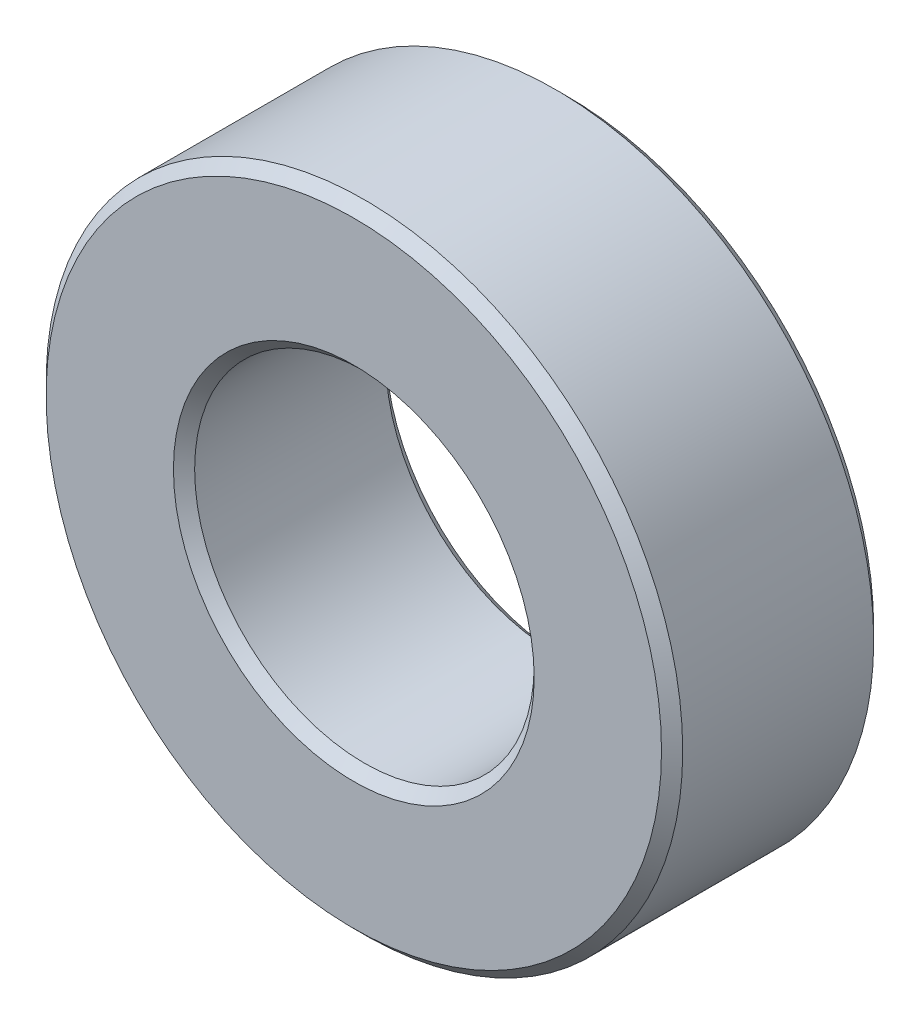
ISO-10303-21;
HEADER;
FILE_DESCRIPTION(('STEP AP214'),'2;1');
FILE_NAME('part.step','',(''),(''),'','','');
FILE_SCHEMA(('AUTOMOTIVE_DESIGN { 1 0 10303 214 1 1 1 1 }'));
ENDSEC;
DATA;
#1=APPLICATION_CONTEXT('core data for automotive mechanical design processes');
#2=APPLICATION_PROTOCOL_DEFINITION('international standard','automotive_design',2000,#1);
#3=PRODUCT_CONTEXT('',#1,'mechanical');
#4=PRODUCT('Part','Part','',(#3));
#5=PRODUCT_RELATED_PRODUCT_CATEGORY('part','',(#4));
#6=PRODUCT_DEFINITION_FORMATION('','',#4);
#7=PRODUCT_DEFINITION_CONTEXT('part definition',#1,'design');
#8=PRODUCT_DEFINITION('design','',#6,#7);
#9=PRODUCT_DEFINITION_SHAPE('','',#8);
#10=(LENGTH_UNIT() NAMED_UNIT(*) SI_UNIT(.MILLI.,.METRE.));
#11=(NAMED_UNIT(*) PLANE_ANGLE_UNIT() SI_UNIT($,.RADIAN.));
#12=(NAMED_UNIT(*) SI_UNIT($,.STERADIAN.) SOLID_ANGLE_UNIT());
#13=UNCERTAINTY_MEASURE_WITH_UNIT(LENGTH_MEASURE(1.E-05),#10,'distance_accuracy_value','');
#14=(GEOMETRIC_REPRESENTATION_CONTEXT(3) GLOBAL_UNCERTAINTY_ASSIGNED_CONTEXT((#13)) GLOBAL_UNIT_ASSIGNED_CONTEXT((#10,
#11,#12)) REPRESENTATION_CONTEXT('',''));
#15=CARTESIAN_POINT('',(0.,0.,0.));
#16=DIRECTION('',(0.,0.,1.));
#17=DIRECTION('',(1.,0.,0.));
#18=AXIS2_PLACEMENT_3D('',#15,#16,#17);
#19=CARTESIAN_POINT('',(0.,0.,1.));
#20=DIRECTION('',(0.,0.,1.));
#21=DIRECTION('',(1.,0.,0.));
#22=AXIS2_PLACEMENT_3D('',#19,#20,#21);
#23=PLANE('',#22);
#24=CARTESIAN_POINT('',(0.,0.,1.));
#25=DIRECTION('',(0.,0.,1.));
#26=DIRECTION('',(1.,0.,0.));
#27=AXIS2_PLACEMENT_3D('',#24,#25,#26);
#28=CIRCLE('',#27,1.7);
#29=CARTESIAN_POINT('',(1.7,0.,1.));
#30=VERTEX_POINT('',#29);
#31=EDGE_CURVE('E10',#30,#30,#28,.F.);
#32=ORIENTED_EDGE('',*,*,#31,.T.);
#33=EDGE_LOOP('',(#32));
#34=FACE_BOUND('',#33,.T.);
#35=CARTESIAN_POINT('',(0.,0.,1.));
#36=DIRECTION('',(0.,0.,1.));
#37=DIRECTION('',(1.,0.,0.));
#38=AXIS2_PLACEMENT_3D('',#35,#36,#37);
#39=CIRCLE('',#38,2.9);
#40=CARTESIAN_POINT('',(2.9,0.,1.));
#41=VERTEX_POINT('',#40);
#42=EDGE_CURVE('E45',#41,#41,#39,.T.);
#43=ORIENTED_EDGE('',*,*,#42,.T.);
#44=EDGE_LOOP('',(#43));
#45=FACE_BOUND('',#44,.T.);
#46=ADVANCED_FACE('F37',(#34,#45),#23,.T.);
#47=CARTESIAN_POINT('',(0.,0.,-1.));
#48=DIRECTION('',(0.,0.,1.));
#49=DIRECTION('',(1.,0.,0.));
#50=AXIS2_PLACEMENT_3D('',#47,#48,#49);
#51=PLANE('',#50);
#52=CARTESIAN_POINT('',(0.,0.,-1.));
#53=DIRECTION('',(0.,0.,1.));
#54=DIRECTION('',(1.,0.,0.));
#55=AXIS2_PLACEMENT_3D('',#52,#53,#54);
#56=CIRCLE('',#55,2.9);
#57=CARTESIAN_POINT('',(2.9,0.,-1.));
#58=VERTEX_POINT('',#57);
#59=EDGE_CURVE('E62',#58,#58,#56,.F.);
#60=ORIENTED_EDGE('',*,*,#59,.T.);
#61=EDGE_LOOP('',(#60));
#62=FACE_BOUND('',#61,.T.);
#63=CARTESIAN_POINT('',(0.,0.,-1.));
#64=DIRECTION('',(0.,0.,1.));
#65=DIRECTION('',(1.,0.,0.));
#66=AXIS2_PLACEMENT_3D('',#63,#64,#65);
#67=CIRCLE('',#66,1.7);
#68=CARTESIAN_POINT('',(1.7,0.,-1.));
#69=VERTEX_POINT('',#68);
#70=EDGE_CURVE('E66',#69,#69,#67,.T.);
#71=ORIENTED_EDGE('',*,*,#70,.T.);
#72=EDGE_LOOP('',(#71));
#73=FACE_BOUND('',#72,.T.);
#74=ADVANCED_FACE('F89',(#62,#73),#51,.F.);
#75=CARTESIAN_POINT('',(0.,0.,1.));
#76=DIRECTION('',(0.,0.,-1.));
#77=DIRECTION('',(-1.,0.,0.));
#78=AXIS2_PLACEMENT_3D('',#75,#76,#77);
#79=CYLINDRICAL_SURFACE('',#78,3.);
#80=CARTESIAN_POINT('',(0.,0.,-0.899999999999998));
#81=DIRECTION('',(0.,0.,1.));
#82=DIRECTION('',(1.,0.,0.));
#83=AXIS2_PLACEMENT_3D('',#80,#81,#82);
#84=CIRCLE('',#83,3.);
#85=CARTESIAN_POINT('',(3.,0.,-0.899999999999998));
#86=VERTEX_POINT('',#85);
#87=EDGE_CURVE('E69',#86,#86,#84,.T.);
#88=ORIENTED_EDGE('',*,*,#87,.T.);
#89=EDGE_LOOP('',(#88));
#90=FACE_BOUND('',#89,.T.);
#91=CARTESIAN_POINT('',(0.,0.,0.899999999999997));
#92=DIRECTION('',(0.,0.,1.));
#93=DIRECTION('',(1.,0.,0.));
#94=AXIS2_PLACEMENT_3D('',#91,#92,#93);
#95=CIRCLE('',#94,3.);
#96=CARTESIAN_POINT('',(3.,0.,0.899999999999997));
#97=VERTEX_POINT('',#96);
#98=EDGE_CURVE('E73',#97,#97,#95,.F.);
#99=ORIENTED_EDGE('',*,*,#98,.T.);
#100=EDGE_LOOP('',(#99));
#101=FACE_BOUND('',#100,.T.);
#102=ADVANCED_FACE('F78',(#90,#101),#79,.T.);
#103=CARTESIAN_POINT('',(0.,0.,1.));
#104=DIRECTION('',(0.,0.,-1.));
#105=DIRECTION('',(-1.,0.,0.));
#106=AXIS2_PLACEMENT_3D('',#103,#104,#105);
#107=CYLINDRICAL_SURFACE('',#106,1.6);
#108=CARTESIAN_POINT('',(0.,0.,-0.899999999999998));
#109=DIRECTION('',(0.,0.,1.));
#110=DIRECTION('',(1.,0.,0.));
#111=AXIS2_PLACEMENT_3D('',#108,#109,#110);
#112=CIRCLE('',#111,1.6);
#113=CARTESIAN_POINT('',(1.6,0.,-0.899999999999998));
#114=VERTEX_POINT('',#113);
#115=EDGE_CURVE('E51',#114,#114,#112,.F.);
#116=ORIENTED_EDGE('',*,*,#115,.T.);
#117=EDGE_LOOP('',(#116));
#118=FACE_BOUND('',#117,.T.);
#119=CARTESIAN_POINT('',(0.,0.,0.900000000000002));
#120=DIRECTION('',(0.,0.,1.));
#121=DIRECTION('',(1.,0.,0.));
#122=AXIS2_PLACEMENT_3D('',#119,#120,#121);
#123=CIRCLE('',#122,1.6);
#124=CARTESIAN_POINT('',(1.6,0.,0.900000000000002));
#125=VERTEX_POINT('',#124);
#126=EDGE_CURVE('E57',#125,#125,#123,.T.);
#127=ORIENTED_EDGE('',*,*,#126,.T.);
#128=EDGE_LOOP('',(#127));
#129=FACE_BOUND('',#128,.T.);
#130=ADVANCED_FACE('F97',(#118,#129),#107,.F.);
#131=CARTESIAN_POINT('',(0.,0.,-0.899999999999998));
#132=DIRECTION('',(0.,0.,1.));
#133=DIRECTION('',(1.,0.,0.));
#134=AXIS2_PLACEMENT_3D('',#131,#132,#133);
#135=CONICAL_SURFACE('',#134,3.,0.78539816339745);
#136=ORIENTED_EDGE('',*,*,#59,.F.);
#137=EDGE_LOOP('',(#136));
#138=FACE_BOUND('',#137,.T.);
#139=ORIENTED_EDGE('',*,*,#87,.F.);
#140=EDGE_LOOP('',(#139));
#141=FACE_BOUND('',#140,.T.);
#142=ADVANCED_FACE('F102',(#138,#141),#135,.T.);
#143=CARTESIAN_POINT('',(0.,0.,-1.));
#144=DIRECTION('',(0.,0.,-1.));
#145=DIRECTION('',(-1.,0.,0.));
#146=AXIS2_PLACEMENT_3D('',#143,#144,#145);
#147=CONICAL_SURFACE('',#146,1.7,0.785398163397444);
#148=ORIENTED_EDGE('',*,*,#115,.F.);
#149=EDGE_LOOP('',(#148));
#150=FACE_BOUND('',#149,.T.);
#151=ORIENTED_EDGE('',*,*,#70,.F.);
#152=EDGE_LOOP('',(#151));
#153=FACE_BOUND('',#152,.T.);
#154=ADVANCED_FACE('F86',(#150,#153),#147,.F.);
#155=CARTESIAN_POINT('',(0.,0.,0.900000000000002));
#156=DIRECTION('',(0.,0.,1.));
#157=DIRECTION('',(1.,0.,0.));
#158=AXIS2_PLACEMENT_3D('',#155,#156,#157);
#159=CONICAL_SURFACE('',#158,1.6,0.785398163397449);
#160=ORIENTED_EDGE('',*,*,#31,.F.);
#161=EDGE_LOOP('',(#160));
#162=FACE_BOUND('',#161,.T.);
#163=ORIENTED_EDGE('',*,*,#126,.F.);
#164=EDGE_LOOP('',(#163));
#165=FACE_BOUND('',#164,.T.);
#166=ADVANCED_FACE('F82',(#162,#165),#159,.F.);
#167=CARTESIAN_POINT('',(0.,0.,1.));
#168=DIRECTION('',(0.,0.,-1.));
#169=DIRECTION('',(-1.,0.,0.));
#170=AXIS2_PLACEMENT_3D('',#167,#168,#169);
#171=CONICAL_SURFACE('',#170,2.9,0.785398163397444);
#172=ORIENTED_EDGE('',*,*,#98,.F.);
#173=EDGE_LOOP('',(#172));
#174=FACE_BOUND('',#173,.T.);
#175=ORIENTED_EDGE('',*,*,#42,.F.);
#176=EDGE_LOOP('',(#175));
#177=FACE_BOUND('',#176,.T.);
#178=ADVANCED_FACE('F39',(#174,#177),#171,.T.);
#179=CLOSED_SHELL('',(#46,#74,#102,#130,#142,#154,#166,#178));
#180=MANIFOLD_SOLID_BREP('B2',#179);
#181=ADVANCED_BREP_SHAPE_REPRESENTATION('',(#18,#180),#14);
#182=SHAPE_DEFINITION_REPRESENTATION(#9,#181);
ENDSEC;
END-ISO-10303-21;
